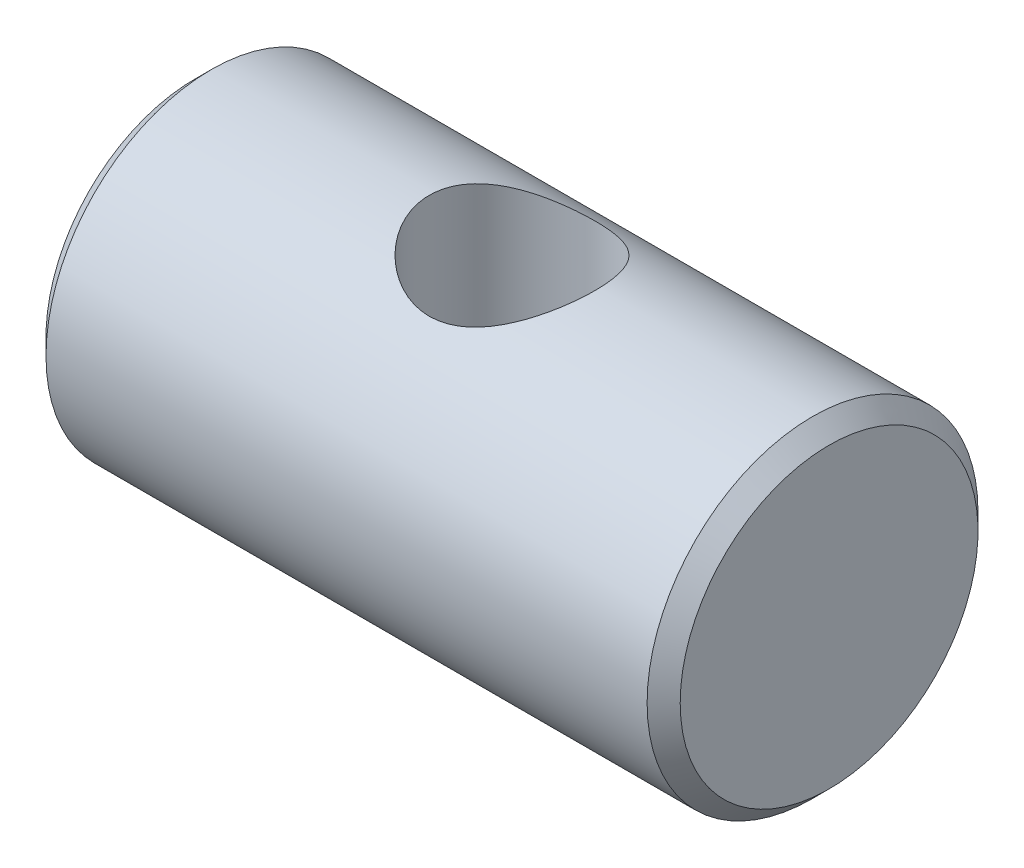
ISO-10303-21;
HEADER;
FILE_DESCRIPTION(('STEP AP214'),'2;1');
FILE_NAME('part.step','',(''),(''),'','','');
FILE_SCHEMA(('AUTOMOTIVE_DESIGN { 1 0 10303 214 1 1 1 1 }'));
ENDSEC;
DATA;
#1=APPLICATION_CONTEXT('core data for automotive mechanical design processes');
#2=APPLICATION_PROTOCOL_DEFINITION('international standard','automotive_design',2000,#1);
#3=PRODUCT_CONTEXT('',#1,'mechanical');
#4=PRODUCT('Part','Part','',(#3));
#5=PRODUCT_RELATED_PRODUCT_CATEGORY('part','',(#4));
#6=PRODUCT_DEFINITION_FORMATION('','',#4);
#7=PRODUCT_DEFINITION_CONTEXT('part definition',#1,'design');
#8=PRODUCT_DEFINITION('design','',#6,#7);
#9=PRODUCT_DEFINITION_SHAPE('','',#8);
#10=(LENGTH_UNIT() NAMED_UNIT(*) SI_UNIT(.MILLI.,.METRE.));
#11=(NAMED_UNIT(*) PLANE_ANGLE_UNIT() SI_UNIT($,.RADIAN.));
#12=(NAMED_UNIT(*) SI_UNIT($,.STERADIAN.) SOLID_ANGLE_UNIT());
#13=UNCERTAINTY_MEASURE_WITH_UNIT(LENGTH_MEASURE(1.E-05),#10,'distance_accuracy_value','');
#14=(GEOMETRIC_REPRESENTATION_CONTEXT(3) GLOBAL_UNCERTAINTY_ASSIGNED_CONTEXT((#13)) GLOBAL_UNIT_ASSIGNED_CONTEXT((#10,
#11,#12)) REPRESENTATION_CONTEXT('',''));
#15=CARTESIAN_POINT('',(0.,0.,0.));
#16=DIRECTION('',(0.,0.,1.));
#17=DIRECTION('',(1.,0.,0.));
#18=AXIS2_PLACEMENT_3D('',#15,#16,#17);
#19=CARTESIAN_POINT('',(5.75,2.7,0.));
#20=DIRECTION('',(-1.,0.,0.));
#21=DIRECTION('',(0.,0.,1.));
#22=AXIS2_PLACEMENT_3D('',#19,#20,#21);
#23=PLANE('',#22);
#24=CARTESIAN_POINT('',(5.75000000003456,0.,0.));
#25=DIRECTION('',(-1.,0.,0.));
#26=DIRECTION('',(0.,0.,1.));
#27=AXIS2_PLACEMENT_3D('',#24,#25,#26);
#28=CIRCLE('',#27,2.70000000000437);
#29=CARTESIAN_POINT('',(5.75000000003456,0.,2.70000000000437));
#30=VERTEX_POINT('',#29);
#31=EDGE_CURVE('E62',#30,#30,#28,.T.);
#32=ORIENTED_EDGE('',*,*,#31,.F.);
#33=EDGE_LOOP('',(#32));
#34=FACE_BOUND('',#33,.T.);
#35=ADVANCED_FACE('F12',(#34),#23,.F.);
#36=CARTESIAN_POINT('',(-5.75,0.,0.));
#37=DIRECTION('',(1.,0.,0.));
#38=DIRECTION('',(0.,0.,-1.));
#39=AXIS2_PLACEMENT_3D('',#36,#37,#38);
#40=PLANE('',#39);
#41=CARTESIAN_POINT('',(-5.74999999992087,0.,0.));
#42=DIRECTION('',(1.,0.,0.));
#43=DIRECTION('',(0.,0.,-1.));
#44=AXIS2_PLACEMENT_3D('',#41,#42,#43);
#45=CIRCLE('',#44,2.70000000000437);
#46=CARTESIAN_POINT('',(-5.74999999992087,0.,-2.70000000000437));
#47=VERTEX_POINT('',#46);
#48=EDGE_CURVE('E64',#47,#47,#45,.T.);
#49=ORIENTED_EDGE('',*,*,#48,.F.);
#50=EDGE_LOOP('',(#49));
#51=FACE_BOUND('',#50,.T.);
#52=ADVANCED_FACE('F53',(#51),#40,.F.);
#53=CARTESIAN_POINT('',(5.45000000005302,0.,0.));
#54=DIRECTION('',(-1.,0.,0.));
#55=DIRECTION('',(0.,0.,1.));
#56=AXIS2_PLACEMENT_3D('',#53,#54,#55);
#57=CONICAL_SURFACE('',#56,2.99999999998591,0.785398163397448);
#58=CARTESIAN_POINT('',(5.45,0.,0.));
#59=DIRECTION('',(1.,0.,0.));
#60=DIRECTION('',(0.,0.,-1.));
#61=AXIS2_PLACEMENT_3D('',#58,#59,#60);
#62=CIRCLE('',#61,3.);
#63=CARTESIAN_POINT('',(5.45,0.,-3.));
#64=VERTEX_POINT('',#63);
#65=EDGE_CURVE('E31',#64,#64,#62,.F.);
#66=ORIENTED_EDGE('',*,*,#65,.F.);
#67=EDGE_LOOP('',(#66));
#68=FACE_BOUND('',#67,.T.);
#69=ORIENTED_EDGE('',*,*,#31,.T.);
#70=EDGE_LOOP('',(#69));
#71=FACE_BOUND('',#70,.T.);
#72=ADVANCED_FACE('F58',(#68,#71),#57,.T.);
#73=CARTESIAN_POINT('',(-5.45000000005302,0.,0.));
#74=DIRECTION('',(1.,0.,0.));
#75=DIRECTION('',(0.,0.,-1.));
#76=AXIS2_PLACEMENT_3D('',#73,#74,#75);
#77=CONICAL_SURFACE('',#76,2.99999999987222,0.785398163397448);
#78=ORIENTED_EDGE('',*,*,#48,.T.);
#79=EDGE_LOOP('',(#78));
#80=FACE_BOUND('',#79,.T.);
#81=CARTESIAN_POINT('',(-5.45,0.,0.));
#82=DIRECTION('',(1.,0.,0.));
#83=DIRECTION('',(0.,0.,-1.));
#84=AXIS2_PLACEMENT_3D('',#81,#82,#83);
#85=CIRCLE('',#84,3.);
#86=CARTESIAN_POINT('',(-5.45,0.,-3.));
#87=VERTEX_POINT('',#86);
#88=EDGE_CURVE('E27',#87,#87,#85,.T.);
#89=ORIENTED_EDGE('',*,*,#88,.F.);
#90=EDGE_LOOP('',(#89));
#91=FACE_BOUND('',#90,.T.);
#92=ADVANCED_FACE('F50',(#80,#91),#77,.T.);
#93=CARTESIAN_POINT('',(5.75,0.,0.));
#94=DIRECTION('',(1.,0.,0.));
#95=DIRECTION('',(0.,0.,-1.));
#96=AXIS2_PLACEMENT_3D('',#93,#94,#95);
#97=CYLINDRICAL_SURFACE('',#96,3.);
#98=CARTESIAN_POINT('',(1.5,-3.,0.));
#99=CARTESIAN_POINT('',(1.49999504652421,-2.99999570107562,0.0788579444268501));
#100=CARTESIAN_POINT('',(1.49374489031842,-2.99685736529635,0.157809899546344));
#101=CARTESIAN_POINT('',(1.46902067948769,-2.98461234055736,0.313380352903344));
#102=CARTESIAN_POINT('',(1.45052341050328,-2.97549431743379,0.389994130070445));
#103=CARTESIAN_POINT('',(1.40220928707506,-2.95224419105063,0.538400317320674));
#104=CARTESIAN_POINT('',(1.37243642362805,-2.93813158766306,0.610210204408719));
#105=CARTESIAN_POINT('',(1.30264406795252,-2.90618664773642,0.747708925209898));
#106=CARTESIAN_POINT('',(1.2626253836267,-2.88835460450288,0.813398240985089));
#107=CARTESIAN_POINT('',(1.17072412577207,-2.84934387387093,0.941261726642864));
#108=CARTESIAN_POINT('',(1.11827028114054,-2.82802798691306,1.00298281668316));
#109=CARTESIAN_POINT('',(1.00421778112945,-2.78489955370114,1.11716916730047));
#110=CARTESIAN_POINT('',(0.942612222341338,-2.76308664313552,1.16962737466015));
#111=CARTESIAN_POINT('',(0.806274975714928,-2.71948426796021,1.26787800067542));
#112=CARTESIAN_POINT('',(0.730895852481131,-2.69782780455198,1.31283800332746));
#113=CARTESIAN_POINT('',(0.572448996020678,-2.65928968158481,1.38925234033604));
#114=CARTESIAN_POINT('',(0.489386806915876,-2.64240461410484,1.4207163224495));
#115=CARTESIAN_POINT('',(0.323002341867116,-2.61686800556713,1.46719866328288));
#116=CARTESIAN_POINT('',(0.239993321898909,-2.6077840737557,1.48308878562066));
#117=CARTESIAN_POINT('',(0.0720317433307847,-2.59772834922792,1.50064048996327));
#118=CARTESIAN_POINT('',(-0.0129188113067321,-2.59674854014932,1.50231613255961));
#119=CARTESIAN_POINT('',(-0.171429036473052,-2.60266395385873,1.49203093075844));
#120=CARTESIAN_POINT('',(-0.245136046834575,-2.6086314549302,1.48167683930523));
#121=CARTESIAN_POINT('',(-0.389582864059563,-2.62614343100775,1.4504097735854));
#122=CARTESIAN_POINT('',(-0.460321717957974,-2.63768968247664,1.42949343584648));
#123=CARTESIAN_POINT('',(-0.598843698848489,-2.66531214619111,1.37731467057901));
#124=CARTESIAN_POINT('',(-0.666519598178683,-2.68148760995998,1.34582260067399));
#125=CARTESIAN_POINT('',(-0.795951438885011,-2.71655106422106,1.273562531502));
#126=CARTESIAN_POINT('',(-0.857704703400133,-2.73544027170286,1.2327903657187));
#127=CARTESIAN_POINT('',(-0.981781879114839,-2.77669736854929,1.13709908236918));
#128=CARTESIAN_POINT('',(-1.04318531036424,-2.79920265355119,1.08104168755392));
#129=CARTESIAN_POINT('',(-1.15610312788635,-2.84321434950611,0.959333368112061));
#130=CARTESIAN_POINT('',(-1.20761278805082,-2.86472027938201,0.893677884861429));
#131=CARTESIAN_POINT('',(-1.30152849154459,-2.90552980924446,0.750774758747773));
#132=CARTESIAN_POINT('',(-1.34340070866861,-2.92468476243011,0.673130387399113));
#133=CARTESIAN_POINT('',(-1.41314554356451,-2.95736821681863,0.510699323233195));
#134=CARTESIAN_POINT('',(-1.44102927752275,-2.9709011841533,0.425918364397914));
#135=CARTESIAN_POINT('',(-1.47971310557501,-2.98986500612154,0.259149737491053));
#136=CARTESIAN_POINT('',(-1.49173685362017,-2.99587407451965,0.177512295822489));
#137=CARTESIAN_POINT('',(-1.50219709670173,-3.00109520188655,0.0131693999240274));
#138=CARTESIAN_POINT('',(-1.5006400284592,-3.00031048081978,-0.0695355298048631));
#139=CARTESIAN_POINT('',(-1.48468996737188,-2.99236788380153,-0.22684945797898));
#140=CARTESIAN_POINT('',(-1.47130120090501,-2.98570868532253,-0.301589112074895));
#141=CARTESIAN_POINT('',(-1.43364289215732,-2.9673325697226,-0.447610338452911));
#142=CARTESIAN_POINT('',(-1.40937215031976,-2.95561509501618,-0.518891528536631));
#143=CARTESIAN_POINT('',(-1.35000230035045,-2.92776377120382,-0.658332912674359));
#144=CARTESIAN_POINT('',(-1.31461342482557,-2.91151322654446,-0.726345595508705));
#145=CARTESIAN_POINT('',(-1.23433869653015,-2.87615961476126,-0.855692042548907));
#146=CARTESIAN_POINT('',(-1.18944879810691,-2.85705533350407,-0.917022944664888));
#147=CARTESIAN_POINT('',(-1.08635936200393,-2.81562332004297,-1.03765153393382));
#148=CARTESIAN_POINT('',(-1.02728569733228,-2.79316327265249,-1.09615811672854));
#149=CARTESIAN_POINT('',(-0.900112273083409,-2.7489358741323,-1.20278448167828));
#150=CARTESIAN_POINT('',(-0.832006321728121,-2.72716901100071,-1.25089707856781));
#151=CARTESIAN_POINT('',(-0.684534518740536,-2.68576788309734,-1.33756187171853));
#152=CARTESIAN_POINT('',(-0.604783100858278,-2.66628794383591,-1.37553824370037));
#153=CARTESIAN_POINT('',(-0.438734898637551,-2.63361108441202,-1.43712423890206));
#154=CARTESIAN_POINT('',(-0.352446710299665,-2.62040607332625,-1.46075237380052));
#155=CARTESIAN_POINT('',(-0.184634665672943,-2.60342251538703,-1.49079253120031));
#156=CARTESIAN_POINT('',(-0.103448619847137,-2.59886075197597,-1.49863949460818));
#157=CARTESIAN_POINT('',(0.0591706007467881,-2.59748031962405,-1.5010337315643));
#158=CARTESIAN_POINT('',(0.140603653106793,-2.60065829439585,-1.49558676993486));
#159=CARTESIAN_POINT('',(0.293225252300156,-2.61356793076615,-1.47288918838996));
#160=CARTESIAN_POINT('',(0.364650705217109,-2.62264641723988,-1.45681247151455));
#161=CARTESIAN_POINT('',(0.50371217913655,-2.64556524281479,-1.41476303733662));
#162=CARTESIAN_POINT('',(0.571346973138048,-2.65940711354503,-1.38878713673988));
#163=CARTESIAN_POINT('',(0.705937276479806,-2.69142795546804,-1.32572361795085));
#164=CARTESIAN_POINT('',(0.772541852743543,-2.70983583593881,-1.28800670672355));
#165=CARTESIAN_POINT('',(0.898911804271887,-2.74852997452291,-1.20322645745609));
#166=CARTESIAN_POINT('',(0.958673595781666,-2.76881720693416,-1.15615825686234));
#167=CARTESIAN_POINT('',(1.07721297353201,-2.81193484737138,-1.04730498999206));
#168=CARTESIAN_POINT('',(1.13498865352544,-2.83477474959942,-0.98442663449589));
#169=CARTESIAN_POINT('',(1.23939447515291,-2.87816628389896,-0.849232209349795));
#170=CARTESIAN_POINT('',(1.28601860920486,-2.89871667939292,-0.776911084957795));
#171=CARTESIAN_POINT('',(1.36685454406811,-2.93547014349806,-0.623897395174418));
#172=CARTESIAN_POINT('',(1.4009762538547,-2.95164144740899,-0.543149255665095));
#173=CARTESIAN_POINT('',(1.45471225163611,-2.9775201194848,-0.376113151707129));
#174=CARTESIAN_POINT('',(1.47436777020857,-2.98724585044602,-0.289841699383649));
#175=CARTESIAN_POINT('',(1.49084611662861,-2.99543192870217,-0.168902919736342));
#176=CARTESIAN_POINT('',(1.49427396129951,-2.99714048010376,-0.135242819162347));
#177=CARTESIAN_POINT('',(1.49885199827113,-2.99942545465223,-0.067727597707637));
#178=CARTESIAN_POINT('',(1.50000212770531,-3.00000184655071,-0.0338724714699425));
#179=CARTESIAN_POINT('',(1.5,-3.,0.));
#180=B_SPLINE_CURVE_WITH_KNOTS('',3,(#98,#99,#100,#101,#102,#103,#104,#105,#106,#107,#108,#109,
#110,#111,#112,#113,#114,#115,#116,#117,#118,#119,#120,#121,#122,#123,#124,#125,#126,#127,#128,
#129,#130,#131,#132,#133,#134,#135,#136,#137,#138,#139,#140,#141,#142,#143,#144,#145,#146,#147,
#148,#149,#150,#151,#152,#153,#154,#155,#156,#157,#158,#159,#160,#161,#162,#163,#164,#165,#166,
#167,#168,#169,#170,#171,#172,#173,#174,#175,#176,#177,#178,#179),.UNSPECIFIED.,.T.,.F.,(4,2,2,
2,2,2,2,2,2,2,2,2,2,2,2,2,2,2,2,2,2,2,2,2,2,2,2,2,2,2,2,2,2,2,2,2,2,2,2,2,4),(0.,
0.236436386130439,0.473322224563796,0.709293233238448,0.945245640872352,1.19547263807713,
1.44588935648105,1.71572589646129,1.98536921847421,2.23887018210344,2.49212035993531,
2.71508568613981,2.93812205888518,3.16635360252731,3.39468781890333,3.65197412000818,
3.90938301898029,4.17874533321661,4.44789325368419,4.69474935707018,4.94148846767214,
5.16910359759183,5.39674382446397,5.63089284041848,5.86514176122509,6.12239415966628,
6.37982382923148,6.64972023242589,6.91926767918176,7.1629396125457,7.40650589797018,
7.62686895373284,7.84730293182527,8.08254685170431,8.31791341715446,8.58187864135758,
8.84598575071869,9.1119602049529,9.37717362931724,9.47872920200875,9.58028757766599),.UNSPECIFIED.);
#181=CARTESIAN_POINT('',(1.5,-3.,0.));
#182=VERTEX_POINT('',#181);
#183=EDGE_CURVE('E8',#182,#182,#180,.T.);
#184=ORIENTED_EDGE('',*,*,#183,.F.);
#185=EDGE_LOOP('',(#184));
#186=FACE_BOUND('',#185,.T.);
#187=CARTESIAN_POINT('',(0.,2.59807621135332,1.5));
#188=CARTESIAN_POINT('',(0.0781617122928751,2.59808302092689,1.4999945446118));
#189=CARTESIAN_POINT('',(0.156422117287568,2.60165701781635,1.49384995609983));
#190=CARTESIAN_POINT('',(0.310540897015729,2.61543549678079,1.46958481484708));
#191=CARTESIAN_POINT('',(0.386393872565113,2.62565391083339,1.45143909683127));
#192=CARTESIAN_POINT('',(0.533177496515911,2.65124019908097,1.40414992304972));
#193=CARTESIAN_POINT('',(0.60413197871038,2.66658065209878,1.3750649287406));
#194=CARTESIAN_POINT('',(0.740136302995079,2.70063997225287,1.30690128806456));
#195=CARTESIAN_POINT('',(0.805185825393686,2.71935902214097,1.26782210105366));
#196=CARTESIAN_POINT('',(0.933458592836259,2.75995303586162,1.17699981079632));
#197=CARTESIAN_POINT('',(0.996088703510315,2.7819609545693,1.12447805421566));
#198=CARTESIAN_POINT('',(1.11211258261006,2.82557974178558,1.0098807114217));
#199=CARTESIAN_POINT('',(1.16550174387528,2.84719040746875,0.94780038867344));
#200=CARTESIAN_POINT('',(1.26505072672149,2.88932215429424,0.81073434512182));
#201=CARTESIAN_POINT('',(1.31048065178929,2.90967159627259,0.735160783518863));
#202=CARTESIAN_POINT('',(1.38771127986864,2.94526134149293,0.576235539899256));
#203=CARTESIAN_POINT('',(1.41952058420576,2.96050486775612,0.492888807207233));
#204=CARTESIAN_POINT('',(1.46625699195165,2.98320691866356,0.327067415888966));
#205=CARTESIAN_POINT('',(1.4822242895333,2.99114220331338,0.244952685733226));
#206=CARTESIAN_POINT('',(1.50024917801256,3.00011375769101,0.0788559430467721));
#207=CARTESIAN_POINT('',(1.50231518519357,3.00115420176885,-0.00512490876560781));
#208=CARTESIAN_POINT('',(1.49287998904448,2.99644472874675,-0.164748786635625));
#209=CARTESIAN_POINT('',(1.48254297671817,2.99127743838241,-0.240481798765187));
#210=CARTESIAN_POINT('',(1.45067873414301,2.97561367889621,-0.388970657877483));
#211=CARTESIAN_POINT('',(1.42915066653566,2.96511681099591,-0.461726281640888));
#212=CARTESIAN_POINT('',(1.37537615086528,2.93957374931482,-0.60346408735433));
#213=CARTESIAN_POINT('',(1.3429855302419,2.92446662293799,-0.672380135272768));
#214=CARTESIAN_POINT('',(1.26860487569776,2.89106468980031,-0.803965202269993));
#215=CARTESIAN_POINT('',(1.22661140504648,2.87276874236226,-0.866631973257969));
#216=CARTESIAN_POINT('',(1.12965697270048,2.83266591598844,-0.990260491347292));
#217=CARTESIAN_POINT('',(1.07384545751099,2.81069063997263,-1.05050111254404));
#218=CARTESIAN_POINT('',(0.953115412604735,2.76681510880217,-1.16115655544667));
#219=CARTESIAN_POINT('',(0.888189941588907,2.74491492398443,-1.21156381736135));
#220=CARTESIAN_POINT('',(0.746027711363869,2.70216234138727,-1.30425800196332));
#221=CARTESIAN_POINT('',(0.668270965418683,2.68146479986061,-1.34582597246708));
#222=CARTESIAN_POINT('',(0.505593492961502,2.64563175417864,-1.41497866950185));
#223=CARTESIAN_POINT('',(0.420680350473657,2.63049045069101,-1.44257798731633));
#224=CARTESIAN_POINT('',(0.253178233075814,2.60916953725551,-1.48077031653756));
#225=CARTESIAN_POINT('',(0.170938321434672,2.60237483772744,-1.49253768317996));
#226=CARTESIAN_POINT('',(0.00539798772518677,2.59676879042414,-1.50227541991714));
#227=CARTESIAN_POINT('',(-0.077901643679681,2.59795180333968,-1.50025553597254));
#228=CARTESIAN_POINT('',(-0.233480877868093,2.60751504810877,-1.48355406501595));
#229=CARTESIAN_POINT('',(-0.305969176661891,2.61509381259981,-1.4702817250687));
#230=CARTESIAN_POINT('',(-0.447551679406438,2.63541032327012,-1.43354442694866));
#231=CARTESIAN_POINT('',(-0.516644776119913,2.64814974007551,-1.41007616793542));
#232=CARTESIAN_POINT('',(-0.653116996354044,2.67804333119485,-1.35247138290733));
#233=CARTESIAN_POINT('',(-0.720268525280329,2.69537464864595,-1.31789109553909));
#234=CARTESIAN_POINT('',(-0.84820390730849,2.73234179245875,-1.23943059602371));
#235=CARTESIAN_POINT('',(-0.908984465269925,2.75197880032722,-1.19554560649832));
#236=CARTESIAN_POINT('',(-1.03046815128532,2.79431997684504,-1.09325575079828));
#237=CARTESIAN_POINT('',(-1.09019572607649,2.81709874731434,-1.03371790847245));
#238=CARTESIAN_POINT('',(-1.19911835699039,2.86101352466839,-0.905106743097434));
#239=CARTESIAN_POINT('',(-1.24830985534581,2.88214897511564,-0.836030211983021));
#240=CARTESIAN_POINT('',(-1.33586058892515,2.92112042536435,-0.687803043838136));
#241=CARTESIAN_POINT('',(-1.37389967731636,2.93885462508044,-0.60843464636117));
#242=CARTESIAN_POINT('',(-1.43570685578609,2.96825032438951,-0.443283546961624));
#243=CARTESIAN_POINT('',(-1.45948747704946,2.9799171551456,-0.357506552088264));
#244=CARTESIAN_POINT('',(-1.49005284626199,2.99501262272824,-0.190469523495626));
#245=CARTESIAN_POINT('',(-1.49819681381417,2.99909891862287,-0.109517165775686));
#246=CARTESIAN_POINT('',(-1.5012648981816,3.00063195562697,0.052688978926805));
#247=CARTESIAN_POINT('',(-1.49619364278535,2.99808102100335,0.13394265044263));
#248=CARTESIAN_POINT('',(-1.47387538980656,2.98700953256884,0.28880698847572));
#249=CARTESIAN_POINT('',(-1.45745272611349,2.97889342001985,0.362568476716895));
#250=CARTESIAN_POINT('',(-1.41400950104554,2.95788140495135,0.506168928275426));
#251=CARTESIAN_POINT('',(-1.38698741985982,2.94498481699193,0.576007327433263));
#252=CARTESIAN_POINT('',(-1.32190942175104,2.9148889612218,0.713135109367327));
#253=CARTESIAN_POINT('',(-1.28343101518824,2.89752925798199,0.78018771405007));
#254=CARTESIAN_POINT('',(-1.19706310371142,2.86032199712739,0.907161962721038));
#255=CARTESIAN_POINT('',(-1.14916927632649,2.84047329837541,0.967080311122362));
#256=CARTESIAN_POINT('',(-1.03980429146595,2.79792915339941,1.08437100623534));
#257=CARTESIAN_POINT('',(-0.977456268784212,2.77514698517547,1.14089652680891));
#258=CARTESIAN_POINT('',(-0.843823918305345,2.73094614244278,1.24299493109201));
#259=CARTESIAN_POINT('',(-0.772531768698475,2.70952868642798,1.28855812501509));
#260=CARTESIAN_POINT('',(-0.620045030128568,2.66999407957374,1.36864661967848));
#261=CARTESIAN_POINT('',(-0.538608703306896,2.65200261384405,1.40277759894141));
#262=CARTESIAN_POINT('',(-0.370001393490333,2.62299234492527,1.45631806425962));
#263=CARTESIAN_POINT('',(-0.282850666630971,2.61195024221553,1.47577678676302));
#264=CARTESIAN_POINT('',(-0.162291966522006,2.60293908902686,1.49155051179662));
#265=CARTESIAN_POINT('',(-0.129948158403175,2.60112193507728,1.49471415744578));
#266=CARTESIAN_POINT('',(-0.065075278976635,2.59868903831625,1.49894010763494));
#267=CARTESIAN_POINT('',(-0.0325461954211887,2.59807337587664,1.50000227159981));
#268=CARTESIAN_POINT('',(0.,2.59807621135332,1.5));
#269=B_SPLINE_CURVE_WITH_KNOTS('',3,(#187,#188,#189,#190,#191,#192,#193,#194,#195,#196,#197,
#198,#199,#200,#201,#202,#203,#204,#205,#206,#207,#208,#209,#210,#211,#212,#213,#214,#215,#216,
#217,#218,#219,#220,#221,#222,#223,#224,#225,#226,#227,#228,#229,#230,#231,#232,#233,#234,#235,
#236,#237,#238,#239,#240,#241,#242,#243,#244,#245,#246,#247,#248,#249,#250,#251,#252,#253,#254,
#255,#256,#257,#258,#259,#260,#261,#262,#263,#264,#265,#266,#267,#268),.UNSPECIFIED.,.T.,.F.,(4,
2,2,2,2,2,2,2,2,2,2,2,2,2,2,2,2,2,2,2,2,2,2,2,2,2,2,2,2,2,2,2,2,2,2,2,2,2,2,2,4),(0.,
0.234348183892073,0.469189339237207,0.702792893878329,0.936409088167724,1.18929346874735,
1.44230356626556,1.71236838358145,1.98226240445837,2.23295227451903,2.4834903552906,
2.71224146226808,2.94100968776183,3.1729430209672,3.40495949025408,3.65890787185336,
3.91305072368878,4.18333262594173,4.45333161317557,4.70193436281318,4.9503613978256,
5.17161275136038,5.39293578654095,5.62450944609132,5.85620229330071,6.1171011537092,
6.37808797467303,6.64596272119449,6.91360169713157,7.1566840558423,7.39968130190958,
7.62666637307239,7.8536840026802,8.09041126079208,8.32724745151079,8.58765362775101,
8.84828914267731,9.11716123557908,9.38512699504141,9.48270202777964,9.58028358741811),.UNSPECIFIED.);
#270=CARTESIAN_POINT('',(0.,2.59807621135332,1.5));
#271=VERTEX_POINT('',#270);
#272=EDGE_CURVE('E23',#271,#271,#269,.T.);
#273=ORIENTED_EDGE('',*,*,#272,.F.);
#274=EDGE_LOOP('',(#273));
#275=FACE_BOUND('',#274,.T.);
#276=ORIENTED_EDGE('',*,*,#88,.T.);
#277=EDGE_LOOP('',(#276));
#278=FACE_BOUND('',#277,.T.);
#279=ORIENTED_EDGE('',*,*,#65,.T.);
#280=EDGE_LOOP('',(#279));
#281=FACE_BOUND('',#280,.T.);
#282=ADVANCED_FACE('F39',(#186,#275,#278,#281),#97,.T.);
#283=CARTESIAN_POINT('',(0.,-3.,0.));
#284=DIRECTION('',(0.,1.,0.));
#285=DIRECTION('',(0.,0.,1.));
#286=AXIS2_PLACEMENT_3D('',#283,#284,#285);
#287=CYLINDRICAL_SURFACE('',#286,1.5);
#288=ORIENTED_EDGE('',*,*,#183,.T.);
#289=EDGE_LOOP('',(#288));
#290=FACE_BOUND('',#289,.T.);
#291=ORIENTED_EDGE('',*,*,#272,.T.);
#292=EDGE_LOOP('',(#291));
#293=FACE_BOUND('',#292,.T.);
#294=ADVANCED_FACE('F42',(#290,#293),#287,.F.);
#295=CLOSED_SHELL('',(#35,#52,#72,#92,#282,#294));
#296=MANIFOLD_SOLID_BREP('B1',#295);
#297=ADVANCED_BREP_SHAPE_REPRESENTATION('',(#18,#296),#14);
#298=SHAPE_DEFINITION_REPRESENTATION(#9,#297);
ENDSEC;
END-ISO-10303-21;
